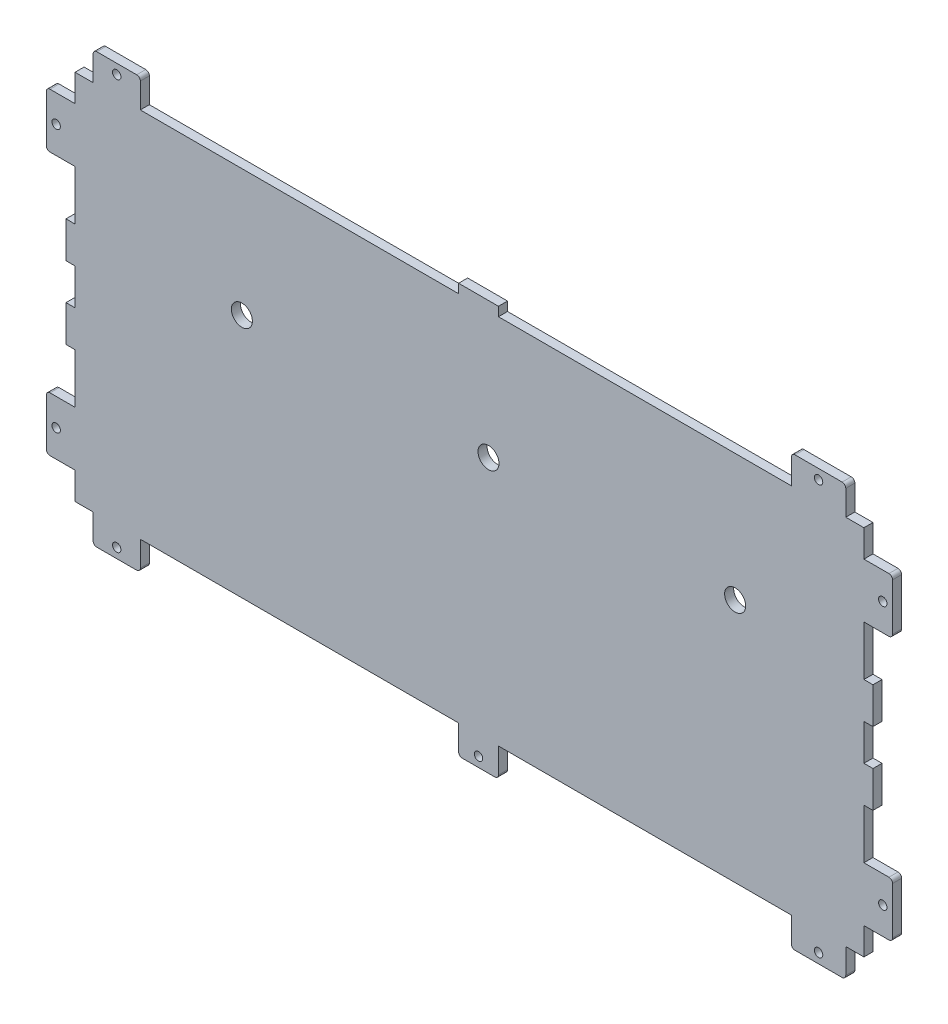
from build123d import *

# Parameters (mm, degrees)
SKETCH1_W             = 276.225
SKETCH1_H             = 130.175
SKETCH1_R             = 3.683
BOSS_EXTRUDE1_DEPTH   = 3.175
SKETCH2_W             = 10.033
SKETCH2_H             = 19.05
SKETCH2_W_2           = 3.175
SKETCH2_H_2           = 12.7
SKETCH2_W_3           = 16.51
SKETCH2_H_3           = 10.033
SKETCH2_W_4           = 13.97
SKETCH2_W_5           = 19.05
SKETCH2_H_4           = 3.175
BOSS_EXTRUDE2_DEPTH   = 3.175
F_4_CLEARANCE_HOLE1_D = 2.9464
FILLET1_R             = 1.27


with BuildPart() as part:
    # Sketch1 → Boss-Extrude1 (new body)
    with BuildSketch(Plane.XY):
        with Locations((138.1125, 65.0875)):
            Rectangle(SKETCH1_W, SKETCH1_H)
        with Locations((58.42, 85.725)):
            Circle(SKETCH1_R, mode=Mode.SUBTRACT)
        with Locations((231.14, 85.725)):
            Circle(SKETCH1_R, mode=Mode.SUBTRACT)
        with Locations(Location((144.78, 85.725, 0), (0, 0, 180))):
            Circle(SKETCH1_R, mode=Mode.SUBTRACT)
    extrude(amount=BOSS_EXTRUDE1_DEPTH)

    # Sketch2 → Boss-Extrude2 (add)
    with BuildSketch(Plane.XY):
        with Locations((281.2415, 19.05)):
            Rectangle(SKETCH2_W, SKETCH2_H)
        with Locations((281.2415, 111.125)):
            Rectangle(SKETCH2_W, SKETCH2_H)
        with Locations((-1.5875, 77.7875)):
            Rectangle(SKETCH2_W_2, SKETCH2_H_2)
        with Locations((277.8125, 77.7875)):
            Rectangle(SKETCH2_W_2, SKETCH2_H_2)
        with Locations((-5.0165, 19.05)):
            Rectangle(SKETCH2_W, SKETCH2_H)
        with Locations((-5.0165, 111.125)):
            Rectangle(SKETCH2_W, SKETCH2_H)
        with Locations((277.8125, 52.3875)):
            Rectangle(SKETCH2_W_2, SKETCH2_H_2)
        with Locations((14.605, -5.0165)):
            Rectangle(SKETCH2_W_3, SKETCH2_H_3)
        with Locations((141.2875, -5.0165)):
            Rectangle(SKETCH2_W_4, SKETCH2_H_3)
        with Locations((260.35, -5.0165)):
            Rectangle(SKETCH2_W_5, SKETCH2_H_3)
        with Locations((14.605, 135.1915)):
            Rectangle(SKETCH2_W_3, SKETCH2_H_3)
        with Locations((260.35, 135.1915)):
            Rectangle(SKETCH2_W_5, SKETCH2_H_3)
        with Locations((141.2875, 131.7625)):
            Rectangle(SKETCH2_W_4, SKETCH2_H_4)
        with Locations((-1.5875, 52.3875)):
            Rectangle(SKETCH2_W_2, SKETCH2_H_2)
    extrude(amount=BOSS_EXTRUDE2_DEPTH)

    # 4 Clearance Hole1 (through all)
    with Locations(Plane.XY.offset(3.175)):
        with Locations((14.605, -6.604), (141.2875, -6.604), (260.35, -6.604), (282.829, 111.125), (-6.604, 111.125), (260.35, 136.779), (14.605, 136.779), (282.829, 19.05), (-6.604, 19.05)):
            Hole(F_4_CLEARANCE_HOLE1_D / 2)

    # Fillet1
    fillet1_edges = [part.edges().sort_by_distance(p)[0] for p in [
        (22.86, -10.033, 1.5875),
        (134.3025, -10.033, 1.5875),
        (148.2725, -10.033, 1.5875),
        (250.825, -10.033, 1.5875),
        (269.875, -10.033, 1.5875),
        (286.258, 9.525, 1.5875),
        (286.258, 28.575, 1.5875),
        (286.258, 101.6, 1.5875),
        (286.258, 120.65, 1.5875),
        (269.875, 140.208, 1.5875),
        (250.825, 140.208, 1.5875),
        (22.86, 140.208, 1.5875),
        (6.35, 140.208, 1.5875),
        (-10.033, 120.65, 1.5875),
        (-10.033, 101.6, 1.5875),
        (-10.033, 28.575, 1.5875),
        (-10.033, 9.525, 1.5875),
        (6.35, -10.033, 1.5875),
    ]]
    fillet(fillet1_edges, radius=FILLET1_R)


solid = part.part
